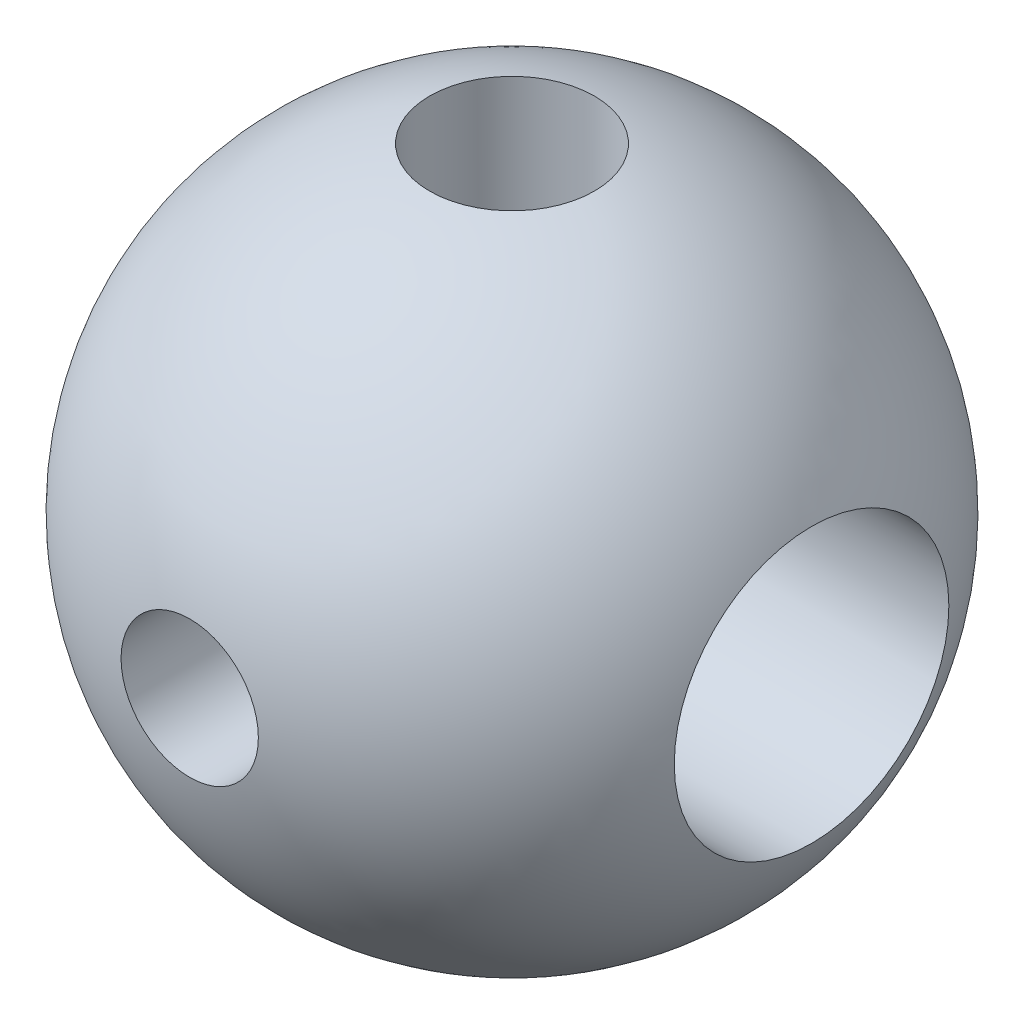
from build123d import *

# Parameters (mm, degrees)
ENL_V_MAT_EXTRU_1_DEPTH      = 84.138438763
ENL_V_MAT_EXTRU_1_DEPTH_BACK = 84.138438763
ESQUISSE2_R                  = 12
ENL_V_MAT_EXTRU_2_DEPTH      = 83.267855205
ENL_V_MAT_EXTRU_2_DEPTH_BACK = 83.267855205
ESQUISSE3_R                  = 20
ENL_V_MAT_EXTRU_3_DEPTH      = 80.799749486
ENL_V_MAT_EXTRU_3_DEPTH_BACK = 80.799749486
ESQUISSE4_R                  = 10


with BuildPart() as part:
    # Esquisse1 → R_volution1 (revolve)
    with BuildSketch(Plane.XY):
        with BuildLine():
            Line((0, 48), (0, -48))
            ThreePointArc((0, -48), (-48, 0), (0, 48))
        make_face()
    revolve(axis=Axis((0, 48, 0), (0, -1, 0)))

    # Esquisse2 → Enl_v. mat.-Extru.1 (cut, two sides: drawn at the far end of the back side and taken through both)
    with BuildSketch(Plane(origin=(0, 0, 0), x_dir=(1, 0, 0), z_dir=(0, 1, 0)).offset(-ENL_V_MAT_EXTRU_1_DEPTH_BACK)):
        Circle(ESQUISSE2_R)
    extrude(amount=ENL_V_MAT_EXTRU_1_DEPTH + ENL_V_MAT_EXTRU_1_DEPTH_BACK, mode=Mode.SUBTRACT)

    # Esquisse3 → Enl_v. mat.-Extru.2 (cut, two sides: drawn at the far end of the back side and taken through both)
    with BuildSketch(Plane(origin=(0, 0, 0), x_dir=(0, 0, -1), z_dir=(1, 0, 0)).offset(-ENL_V_MAT_EXTRU_2_DEPTH_BACK)):
        Circle(ESQUISSE3_R)
    extrude(amount=ENL_V_MAT_EXTRU_2_DEPTH + ENL_V_MAT_EXTRU_2_DEPTH_BACK, mode=Mode.SUBTRACT)

    # Esquisse4 → Enl_v. mat.-Extru.3 (cut, two sides: drawn at the far end of the back side and taken through both)
    with BuildSketch(Plane.XY.offset(-ENL_V_MAT_EXTRU_3_DEPTH_BACK)):
        Circle(ESQUISSE4_R)
    extrude(amount=ENL_V_MAT_EXTRU_3_DEPTH + ENL_V_MAT_EXTRU_3_DEPTH_BACK, mode=Mode.SUBTRACT)


solid = part.part
